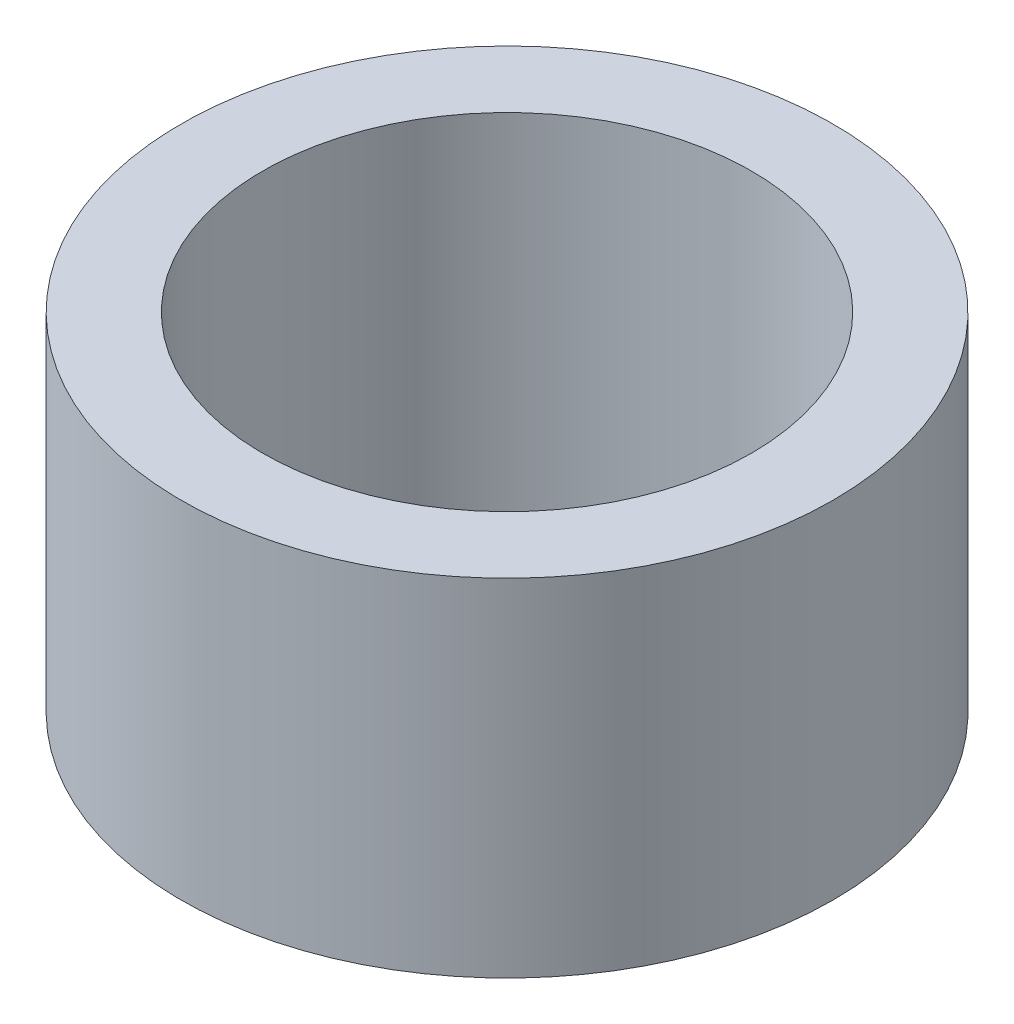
from build123d import *

# Parameters (mm, degrees)
ESQUISSE1_W = 1
ESQUISSE1_H = 4.25


with BuildPart() as part:
    # Esquisse1 → R_volution1 (revolve)
    with BuildSketch(Plane.XY):
        with Locations((3.5, 2.125)):
            Rectangle(ESQUISSE1_W, ESQUISSE1_H)
    revolve(axis=Axis((0, 4.25, 0), (0, -1, 0)))


solid = part.part
